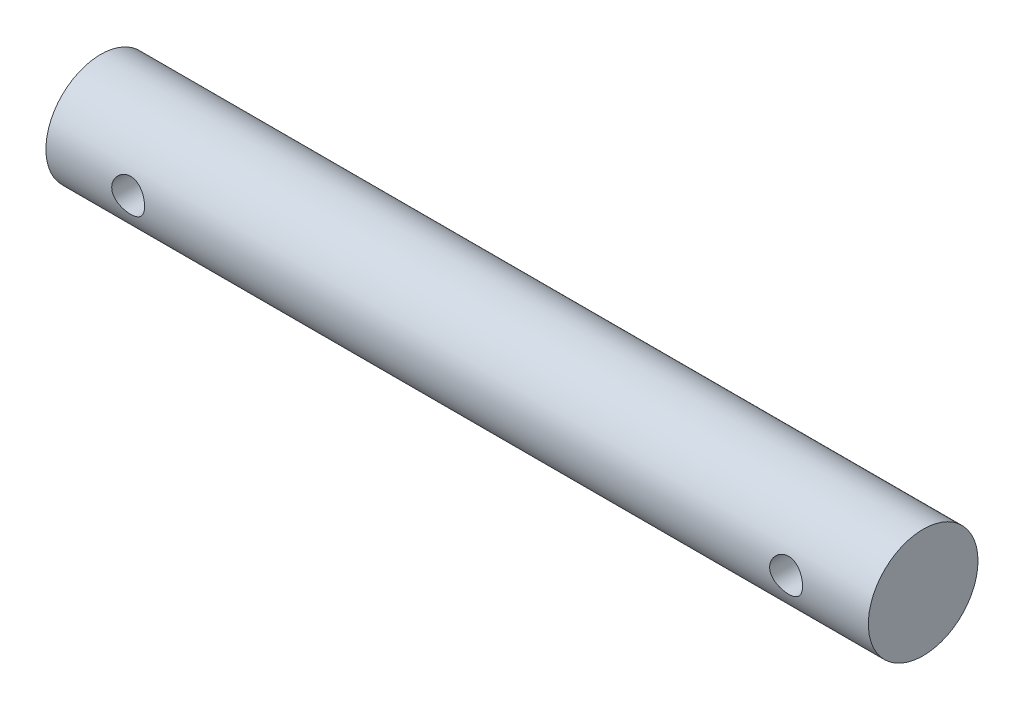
from build123d import *

# Parameters (mm, degrees)
SKIZZE1_R                        = 20
LINEAR_AUSTRAGEN1_DEPTH          = 150
F_12_0_12_DURCHMESSER_BOHRUNG1_D = 12


with BuildPart() as part:
    # Skizze1 → Linear austragen1 (new, symmetric)
    with BuildSketch(Plane(origin=(0, 0, 0), x_dir=(0, 0, -1), z_dir=(1, 0, 0))):
        Circle(SKIZZE1_R)
    extrude(amount=LINEAR_AUSTRAGEN1_DEPTH, both=True)

    # 12.0 _12_ Durchmesser Bohrung1 (through all)
    with Locations(Plane(origin=(0, 0, -20), x_dir=(0, -1, 0), z_dir=(0, 0, -1))):
        with Locations((0, 120), (0, -120)):
            Hole(F_12_0_12_DURCHMESSER_BOHRUNG1_D / 2)


solid = part.part
